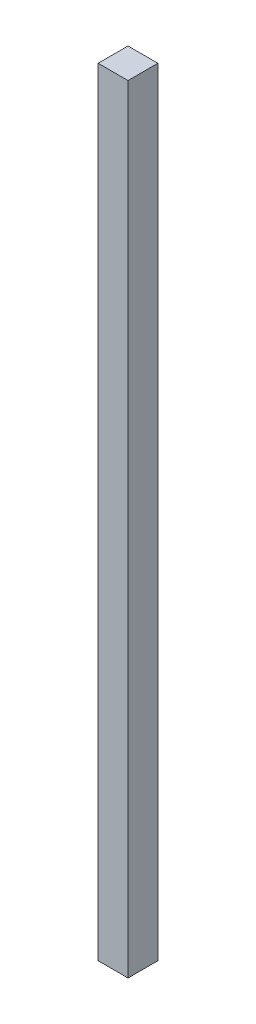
ISO-10303-21;
HEADER;
FILE_DESCRIPTION(('STEP AP214'),'2;1');
FILE_NAME('part.step','',(''),(''),'','','');
FILE_SCHEMA(('AUTOMOTIVE_DESIGN { 1 0 10303 214 1 1 1 1 }'));
ENDSEC;
DATA;
#1=APPLICATION_CONTEXT('core data for automotive mechanical design processes');
#2=APPLICATION_PROTOCOL_DEFINITION('international standard','automotive_design',2000,#1);
#3=PRODUCT_CONTEXT('',#1,'mechanical');
#4=PRODUCT('Part','Part','',(#3));
#5=PRODUCT_RELATED_PRODUCT_CATEGORY('part','',(#4));
#6=PRODUCT_DEFINITION_FORMATION('','',#4);
#7=PRODUCT_DEFINITION_CONTEXT('part definition',#1,'design');
#8=PRODUCT_DEFINITION('design','',#6,#7);
#9=PRODUCT_DEFINITION_SHAPE('','',#8);
#10=(LENGTH_UNIT() NAMED_UNIT(*) SI_UNIT(.MILLI.,.METRE.));
#11=(NAMED_UNIT(*) PLANE_ANGLE_UNIT() SI_UNIT($,.RADIAN.));
#12=(NAMED_UNIT(*) SI_UNIT($,.STERADIAN.) SOLID_ANGLE_UNIT());
#13=UNCERTAINTY_MEASURE_WITH_UNIT(LENGTH_MEASURE(1.E-05),#10,'distance_accuracy_value','');
#14=(GEOMETRIC_REPRESENTATION_CONTEXT(3) GLOBAL_UNCERTAINTY_ASSIGNED_CONTEXT((#13)) GLOBAL_UNIT_ASSIGNED_CONTEXT((#10,
#11,#12)) REPRESENTATION_CONTEXT('',''));
#15=CARTESIAN_POINT('',(0.,0.,0.));
#16=DIRECTION('',(0.,0.,1.));
#17=DIRECTION('',(1.,0.,0.));
#18=AXIS2_PLACEMENT_3D('',#15,#16,#17);
#19=CARTESIAN_POINT('',(0.,0.,12.));
#20=DIRECTION('',(1.,0.,0.));
#21=DIRECTION('',(0.,0.,-1.));
#22=AXIS2_PLACEMENT_3D('',#19,#20,#21);
#23=PLANE('',#22);
#24=DIRECTION('',(0.,-1.,0.));
#25=VECTOR('',#24,1.);
#26=CARTESIAN_POINT('',(0.,0.,0.));
#27=LINE('',#26,#25);
#28=CARTESIAN_POINT('',(0.,312.,0.));
#29=VERTEX_POINT('',#28);
#30=CARTESIAN_POINT('',(0.,0.,0.));
#31=VERTEX_POINT('',#30);
#32=EDGE_CURVE('E113',#29,#31,#27,.T.);
#33=ORIENTED_EDGE('',*,*,#32,.T.);
#34=DIRECTION('',(0.,0.,-1.));
#35=VECTOR('',#34,1.);
#36=CARTESIAN_POINT('',(0.,0.,12.));
#37=LINE('',#36,#35);
#38=CARTESIAN_POINT('',(0.,0.,12.));
#39=VERTEX_POINT('',#38);
#40=EDGE_CURVE('E11',#39,#31,#37,.T.);
#41=ORIENTED_EDGE('',*,*,#40,.F.);
#42=DIRECTION('',(0.,-1.,0.));
#43=VECTOR('',#42,1.);
#44=CARTESIAN_POINT('',(0.,0.,12.));
#45=LINE('',#44,#43);
#46=CARTESIAN_POINT('',(0.,312.,12.));
#47=VERTEX_POINT('',#46);
#48=EDGE_CURVE('E97',#47,#39,#45,.T.);
#49=ORIENTED_EDGE('',*,*,#48,.F.);
#50=DIRECTION('',(0.,0.,-1.));
#51=VECTOR('',#50,1.);
#52=CARTESIAN_POINT('',(0.,312.,12.));
#53=LINE('',#52,#51);
#54=EDGE_CURVE('E109',#47,#29,#53,.T.);
#55=ORIENTED_EDGE('',*,*,#54,.T.);
#56=EDGE_LOOP('',(#33,#41,#49,#55));
#57=FACE_BOUND('',#56,.T.);
#58=ADVANCED_FACE('F45',(#57),#23,.F.);
#59=CARTESIAN_POINT('',(0.,0.,12.));
#60=DIRECTION('',(0.,1.,0.));
#61=DIRECTION('',(0.,0.,1.));
#62=AXIS2_PLACEMENT_3D('',#59,#60,#61);
#63=PLANE('',#62);
#64=DIRECTION('',(1.,0.,0.));
#65=VECTOR('',#64,1.);
#66=CARTESIAN_POINT('',(0.,0.,0.));
#67=LINE('',#66,#65);
#68=CARTESIAN_POINT('',(12.,0.,0.));
#69=VERTEX_POINT('',#68);
#70=EDGE_CURVE('E102',#31,#69,#67,.T.);
#71=ORIENTED_EDGE('',*,*,#70,.T.);
#72=DIRECTION('',(0.,0.,-1.));
#73=VECTOR('',#72,1.);
#74=CARTESIAN_POINT('',(12.,0.,12.));
#75=LINE('',#74,#73);
#76=CARTESIAN_POINT('',(12.,0.,12.));
#77=VERTEX_POINT('',#76);
#78=EDGE_CURVE('E54',#77,#69,#75,.T.);
#79=ORIENTED_EDGE('',*,*,#78,.F.);
#80=DIRECTION('',(1.,0.,0.));
#81=VECTOR('',#80,1.);
#82=CARTESIAN_POINT('',(0.,0.,12.));
#83=LINE('',#82,#81);
#84=EDGE_CURVE('E92',#39,#77,#83,.T.);
#85=ORIENTED_EDGE('',*,*,#84,.F.);
#86=ORIENTED_EDGE('',*,*,#40,.T.);
#87=EDGE_LOOP('',(#71,#79,#85,#86));
#88=FACE_BOUND('',#87,.T.);
#89=ADVANCED_FACE('F101',(#88),#63,.F.);
#90=CARTESIAN_POINT('',(12.,0.,12.));
#91=DIRECTION('',(-1.,0.,0.));
#92=DIRECTION('',(0.,0.,1.));
#93=AXIS2_PLACEMENT_3D('',#90,#91,#92);
#94=PLANE('',#93);
#95=DIRECTION('',(0.,1.,0.));
#96=VECTOR('',#95,1.);
#97=CARTESIAN_POINT('',(12.,0.,0.));
#98=LINE('',#97,#96);
#99=CARTESIAN_POINT('',(12.,312.,0.));
#100=VERTEX_POINT('',#99);
#101=EDGE_CURVE('E79',#69,#100,#98,.T.);
#102=ORIENTED_EDGE('',*,*,#101,.T.);
#103=DIRECTION('',(0.,0.,-1.));
#104=VECTOR('',#103,1.);
#105=CARTESIAN_POINT('',(12.,312.,12.));
#106=LINE('',#105,#104);
#107=CARTESIAN_POINT('',(12.,312.,12.));
#108=VERTEX_POINT('',#107);
#109=EDGE_CURVE('E104',#108,#100,#106,.T.);
#110=ORIENTED_EDGE('',*,*,#109,.F.);
#111=DIRECTION('',(0.,1.,0.));
#112=VECTOR('',#111,1.);
#113=CARTESIAN_POINT('',(12.,0.,12.));
#114=LINE('',#113,#112);
#115=EDGE_CURVE('E95',#77,#108,#114,.T.);
#116=ORIENTED_EDGE('',*,*,#115,.F.);
#117=ORIENTED_EDGE('',*,*,#78,.T.);
#118=EDGE_LOOP('',(#102,#110,#116,#117));
#119=FACE_BOUND('',#118,.T.);
#120=ADVANCED_FACE('F105',(#119),#94,.F.);
#121=CARTESIAN_POINT('',(0.,312.,12.));
#122=DIRECTION('',(0.,-1.,0.));
#123=DIRECTION('',(0.,0.,-1.));
#124=AXIS2_PLACEMENT_3D('',#121,#122,#123);
#125=PLANE('',#124);
#126=DIRECTION('',(-1.,0.,0.));
#127=VECTOR('',#126,1.);
#128=CARTESIAN_POINT('',(0.,312.,0.));
#129=LINE('',#128,#127);
#130=EDGE_CURVE('E85',#100,#29,#129,.T.);
#131=ORIENTED_EDGE('',*,*,#130,.T.);
#132=ORIENTED_EDGE('',*,*,#54,.F.);
#133=DIRECTION('',(-1.,0.,0.));
#134=VECTOR('',#133,1.);
#135=CARTESIAN_POINT('',(0.,312.,12.));
#136=LINE('',#135,#134);
#137=EDGE_CURVE('E62',#108,#47,#136,.T.);
#138=ORIENTED_EDGE('',*,*,#137,.F.);
#139=ORIENTED_EDGE('',*,*,#109,.T.);
#140=EDGE_LOOP('',(#131,#132,#138,#139));
#141=FACE_BOUND('',#140,.T.);
#142=ADVANCED_FACE('F126',(#141),#125,.F.);
#143=CARTESIAN_POINT('',(0.,0.,12.));
#144=DIRECTION('',(0.,0.,-1.));
#145=DIRECTION('',(-1.,0.,0.));
#146=AXIS2_PLACEMENT_3D('',#143,#144,#145);
#147=PLANE('',#146);
#148=ORIENTED_EDGE('',*,*,#48,.T.);
#149=ORIENTED_EDGE('',*,*,#84,.T.);
#150=ORIENTED_EDGE('',*,*,#115,.T.);
#151=ORIENTED_EDGE('',*,*,#137,.T.);
#152=EDGE_LOOP('',(#148,#149,#150,#151));
#153=FACE_BOUND('',#152,.T.);
#154=ADVANCED_FACE('F93',(#153),#147,.F.);
#155=CARTESIAN_POINT('',(0.,0.,0.));
#156=DIRECTION('',(0.,0.,-1.));
#157=DIRECTION('',(-1.,0.,0.));
#158=AXIS2_PLACEMENT_3D('',#155,#156,#157);
#159=PLANE('',#158);
#160=ORIENTED_EDGE('',*,*,#32,.F.);
#161=ORIENTED_EDGE('',*,*,#130,.F.);
#162=ORIENTED_EDGE('',*,*,#101,.F.);
#163=ORIENTED_EDGE('',*,*,#70,.F.);
#164=EDGE_LOOP('',(#160,#161,#162,#163));
#165=FACE_BOUND('',#164,.T.);
#166=ADVANCED_FACE('F129',(#165),#159,.T.);
#167=CLOSED_SHELL('',(#58,#89,#120,#142,#154,#166));
#168=MANIFOLD_SOLID_BREP('B2',#167);
#169=ADVANCED_BREP_SHAPE_REPRESENTATION('',(#18,#168),#14);
#170=SHAPE_DEFINITION_REPRESENTATION(#9,#169);
ENDSEC;
END-ISO-10303-21;
